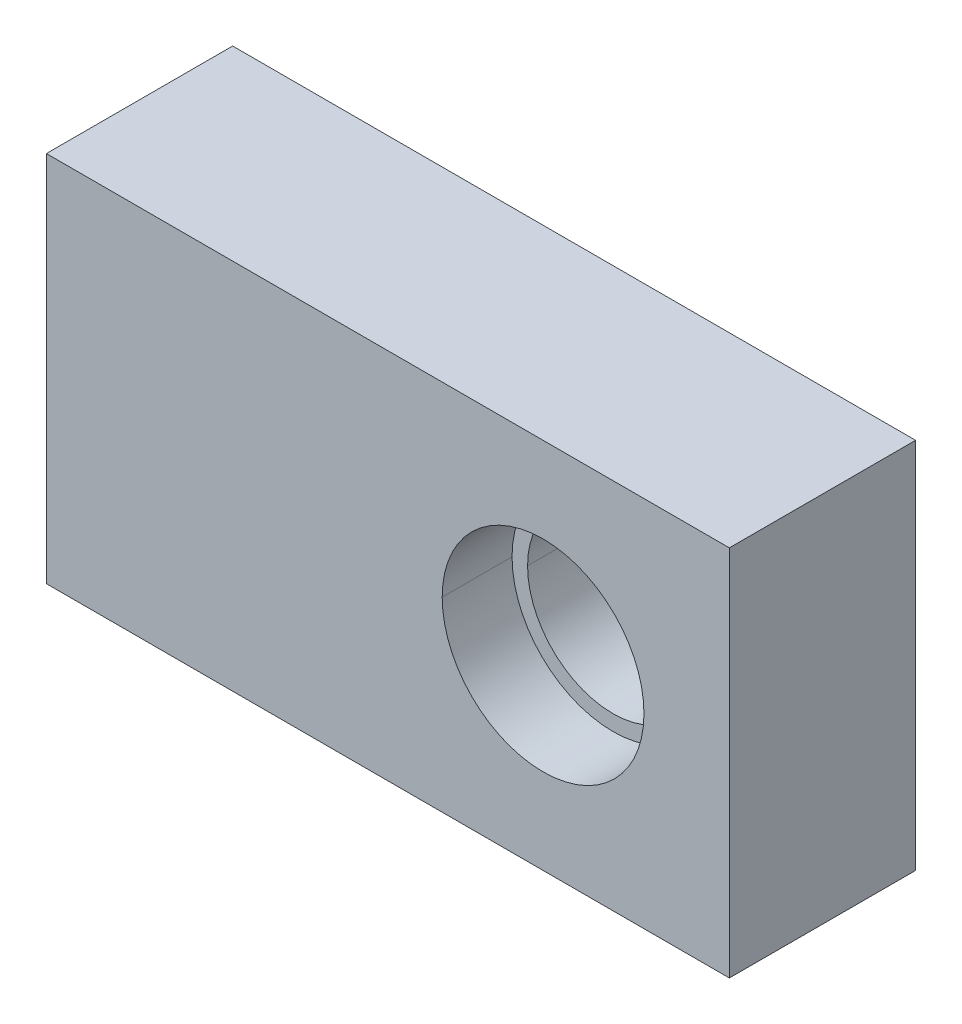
ISO-10303-21;
HEADER;
FILE_DESCRIPTION(('STEP AP214'),'2;1');
FILE_NAME('part.step','',(''),(''),'','','');
FILE_SCHEMA(('AUTOMOTIVE_DESIGN { 1 0 10303 214 1 1 1 1 }'));
ENDSEC;
DATA;
#1=APPLICATION_CONTEXT('core data for automotive mechanical design processes');
#2=APPLICATION_PROTOCOL_DEFINITION('international standard','automotive_design',2000,#1);
#3=PRODUCT_CONTEXT('',#1,'mechanical');
#4=PRODUCT('Part','Part','',(#3));
#5=PRODUCT_RELATED_PRODUCT_CATEGORY('part','',(#4));
#6=PRODUCT_DEFINITION_FORMATION('','',#4);
#7=PRODUCT_DEFINITION_CONTEXT('part definition',#1,'design');
#8=PRODUCT_DEFINITION('design','',#6,#7);
#9=PRODUCT_DEFINITION_SHAPE('','',#8);
#10=(LENGTH_UNIT() NAMED_UNIT(*) SI_UNIT(.MILLI.,.METRE.));
#11=(NAMED_UNIT(*) PLANE_ANGLE_UNIT() SI_UNIT($,.RADIAN.));
#12=(NAMED_UNIT(*) SI_UNIT($,.STERADIAN.) SOLID_ANGLE_UNIT());
#13=UNCERTAINTY_MEASURE_WITH_UNIT(LENGTH_MEASURE(1.E-05),#10,'distance_accuracy_value','');
#14=(GEOMETRIC_REPRESENTATION_CONTEXT(3) GLOBAL_UNCERTAINTY_ASSIGNED_CONTEXT((#13)) GLOBAL_UNIT_ASSIGNED_CONTEXT((#10,
#11,#12)) REPRESENTATION_CONTEXT('',''));
#15=CARTESIAN_POINT('',(0.,0.,0.));
#16=DIRECTION('',(0.,0.,1.));
#17=DIRECTION('',(1.,0.,0.));
#18=AXIS2_PLACEMENT_3D('',#15,#16,#17);
#19=CARTESIAN_POINT('',(-44.45,-19.05,0.));
#20=DIRECTION('',(1.,0.,0.));
#21=DIRECTION('',(0.,0.,-1.));
#22=AXIS2_PLACEMENT_3D('',#19,#20,#21);
#23=PLANE('',#22);
#24=CARTESIAN_POINT('',(-44.45,-19.05,0.));
#25=DIRECTION('',(-1.,0.,0.));
#26=DIRECTION('',(0.,0.,1.));
#27=AXIS2_PLACEMENT_3D('',#24,#25,#26);
#28=CIRCLE('',#27,3.96875);
#29=CARTESIAN_POINT('',(-44.45,-23.01875,0.));
#30=VERTEX_POINT('',#29);
#31=CARTESIAN_POINT('',(-44.45,-15.08125,0.));
#32=VERTEX_POINT('',#31);
#33=EDGE_CURVE('E163',#30,#32,#28,.T.);
#34=ORIENTED_EDGE('',*,*,#33,.T.);
#35=CARTESIAN_POINT('',(-44.45,-19.05,0.));
#36=DIRECTION('',(-1.,0.,0.));
#37=DIRECTION('',(0.,0.,1.));
#38=AXIS2_PLACEMENT_3D('',#35,#36,#37);
#39=CIRCLE('',#38,3.96875);
#40=EDGE_CURVE('E119',#32,#30,#39,.T.);
#41=ORIENTED_EDGE('',*,*,#40,.T.);
#42=EDGE_LOOP('',(#34,#41));
#43=FACE_BOUND('',#42,.T.);
#44=ADVANCED_FACE('F16',(#43),#23,.F.);
#45=CARTESIAN_POINT('',(-44.45,19.05,0.));
#46=DIRECTION('',(1.,0.,0.));
#47=DIRECTION('',(0.,0.,-1.));
#48=AXIS2_PLACEMENT_3D('',#45,#46,#47);
#49=PLANE('',#48);
#50=CARTESIAN_POINT('',(-44.45,19.05,0.));
#51=DIRECTION('',(-1.,0.,0.));
#52=DIRECTION('',(0.,0.,1.));
#53=AXIS2_PLACEMENT_3D('',#50,#51,#52);
#54=CIRCLE('',#53,3.96875);
#55=CARTESIAN_POINT('',(-44.45,15.08125,0.));
#56=VERTEX_POINT('',#55);
#57=CARTESIAN_POINT('',(-44.45,23.01875,0.));
#58=VERTEX_POINT('',#57);
#59=EDGE_CURVE('E155',#56,#58,#54,.T.);
#60=ORIENTED_EDGE('',*,*,#59,.T.);
#61=CARTESIAN_POINT('',(-44.45,19.05,0.));
#62=DIRECTION('',(-1.,0.,0.));
#63=DIRECTION('',(0.,0.,1.));
#64=AXIS2_PLACEMENT_3D('',#61,#62,#63);
#65=CIRCLE('',#64,3.96875);
#66=EDGE_CURVE('E159',#58,#56,#65,.T.);
#67=ORIENTED_EDGE('',*,*,#66,.T.);
#68=EDGE_LOOP('',(#60,#67));
#69=FACE_BOUND('',#68,.T.);
#70=ADVANCED_FACE('F270',(#69),#49,.F.);
#71=CARTESIAN_POINT('',(31.75,0.,15.08125));
#72=DIRECTION('',(0.,0.,1.));
#73=DIRECTION('',(1.,0.,0.));
#74=AXIS2_PLACEMENT_3D('',#71,#72,#73);
#75=CYLINDRICAL_SURFACE('',#74,20.6375);
#76=CARTESIAN_POINT('',(31.75,0.,19.05));
#77=DIRECTION('',(0.,0.,1.));
#78=DIRECTION('',(1.,0.,0.));
#79=AXIS2_PLACEMENT_3D('',#76,#77,#78);
#80=CIRCLE('',#79,20.6375);
#81=CARTESIAN_POINT('',(52.3875,0.,19.05));
#82=VERTEX_POINT('',#81);
#83=CARTESIAN_POINT('',(11.1125,0.,19.05));
#84=VERTEX_POINT('',#83);
#85=EDGE_CURVE('E121',#82,#84,#80,.T.);
#86=ORIENTED_EDGE('',*,*,#85,.T.);
#87=DIRECTION('',(0.,0.,1.));
#88=VECTOR('',#87,1.);
#89=CARTESIAN_POINT('',(11.1125,0.,15.08125));
#90=LINE('',#89,#88);
#91=CARTESIAN_POINT('',(11.1125,0.,4.7625));
#92=VERTEX_POINT('',#91);
#93=EDGE_CURVE('E115',#84,#92,#90,.F.);
#94=ORIENTED_EDGE('',*,*,#93,.T.);
#95=CARTESIAN_POINT('',(31.75,0.,4.7625));
#96=DIRECTION('',(0.,0.,1.));
#97=DIRECTION('',(1.,0.,0.));
#98=AXIS2_PLACEMENT_3D('',#95,#96,#97);
#99=CIRCLE('',#98,20.6375);
#100=CARTESIAN_POINT('',(52.3875,0.,4.7625));
#101=VERTEX_POINT('',#100);
#102=EDGE_CURVE('E19',#92,#101,#99,.F.);
#103=ORIENTED_EDGE('',*,*,#102,.T.);
#104=DIRECTION('',(0.,0.,1.));
#105=VECTOR('',#104,1.);
#106=CARTESIAN_POINT('',(52.3875,0.,15.08125));
#107=LINE('',#106,#105);
#108=EDGE_CURVE('E108',#101,#82,#107,.T.);
#109=ORIENTED_EDGE('',*,*,#108,.T.);
#110=EDGE_LOOP('',(#86,#94,#103,#109));
#111=FACE_BOUND('',#110,.T.);
#112=ADVANCED_FACE('F120',(#111),#75,.F.);
#113=CARTESIAN_POINT('',(31.75,0.,15.08125));
#114=DIRECTION('',(0.,0.,1.));
#115=DIRECTION('',(1.,0.,0.));
#116=AXIS2_PLACEMENT_3D('',#113,#114,#115);
#117=CYLINDRICAL_SURFACE('',#116,20.6375);
#118=CARTESIAN_POINT('',(31.75,0.,4.7625));
#119=DIRECTION('',(0.,0.,1.));
#120=DIRECTION('',(1.,0.,0.));
#121=AXIS2_PLACEMENT_3D('',#118,#119,#120);
#122=CIRCLE('',#121,20.6375);
#123=EDGE_CURVE('E110',#101,#92,#122,.F.);
#124=ORIENTED_EDGE('',*,*,#123,.T.);
#125=ORIENTED_EDGE('',*,*,#93,.F.);
#126=CARTESIAN_POINT('',(31.75,0.,19.05));
#127=DIRECTION('',(0.,0.,1.));
#128=DIRECTION('',(1.,0.,0.));
#129=AXIS2_PLACEMENT_3D('',#126,#127,#128);
#130=CIRCLE('',#129,20.6375);
#131=EDGE_CURVE('E112',#84,#82,#130,.T.);
#132=ORIENTED_EDGE('',*,*,#131,.T.);
#133=ORIENTED_EDGE('',*,*,#108,.F.);
#134=EDGE_LOOP('',(#124,#125,#132,#133));
#135=FACE_BOUND('',#134,.T.);
#136=ADVANCED_FACE('F109',(#135),#117,.F.);
#137=CARTESIAN_POINT('',(31.7500000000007,0.,4.7625));
#138=DIRECTION('',(0.,0.,-1.));
#139=DIRECTION('',(-1.,0.,0.));
#140=AXIS2_PLACEMENT_3D('',#137,#138,#139);
#141=PLANE('',#140);
#142=ORIENTED_EDGE('',*,*,#102,.F.);
#143=ORIENTED_EDGE('',*,*,#123,.F.);
#144=EDGE_LOOP('',(#142,#143));
#145=FACE_BOUND('',#144,.T.);
#146=CARTESIAN_POINT('',(31.75,0.,4.7625));
#147=DIRECTION('',(0.,0.,1.));
#148=DIRECTION('',(1.,0.,0.));
#149=AXIS2_PLACEMENT_3D('',#146,#147,#148);
#150=CIRCLE('',#149,17.4625);
#151=CARTESIAN_POINT('',(14.2875,1.10707178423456E-13,4.7625));
#152=VERTEX_POINT('',#151);
#153=CARTESIAN_POINT('',(49.2125,0.,4.7625));
#154=VERTEX_POINT('',#153);
#155=EDGE_CURVE('E149',#152,#154,#150,.F.);
#156=ORIENTED_EDGE('',*,*,#155,.T.);
#157=CARTESIAN_POINT('',(31.75,0.,4.7625));
#158=DIRECTION('',(0.,0.,1.));
#159=DIRECTION('',(1.,0.,0.));
#160=AXIS2_PLACEMENT_3D('',#157,#158,#159);
#161=CIRCLE('',#160,17.4625);
#162=EDGE_CURVE('E145',#154,#152,#161,.F.);
#163=ORIENTED_EDGE('',*,*,#162,.T.);
#164=EDGE_LOOP('',(#156,#163));
#165=FACE_BOUND('',#164,.T.);
#166=ADVANCED_FACE('F117',(#145,#165),#141,.F.);
#167=CARTESIAN_POINT('',(-57.15,-19.05,0.));
#168=DIRECTION('',(-1.,0.,0.));
#169=DIRECTION('',(0.,0.,1.));
#170=AXIS2_PLACEMENT_3D('',#167,#168,#169);
#171=CYLINDRICAL_SURFACE('',#170,3.96875);
#172=ORIENTED_EDGE('',*,*,#40,.F.);
#173=DIRECTION('',(-1.,0.,0.));
#174=VECTOR('',#173,1.);
#175=CARTESIAN_POINT('',(-57.15,-15.08125,0.));
#176=LINE('',#175,#174);
#177=CARTESIAN_POINT('',(-69.85,-15.08125,0.));
#178=VERTEX_POINT('',#177);
#179=EDGE_CURVE('E166',#32,#178,#176,.T.);
#180=ORIENTED_EDGE('',*,*,#179,.T.);
#181=CARTESIAN_POINT('',(-69.85,-19.05,0.));
#182=DIRECTION('',(-1.,0.,0.));
#183=DIRECTION('',(0.,0.,1.));
#184=AXIS2_PLACEMENT_3D('',#181,#182,#183);
#185=CIRCLE('',#184,3.96875);
#186=CARTESIAN_POINT('',(-69.85,-23.01875,0.));
#187=VERTEX_POINT('',#186);
#188=EDGE_CURVE('E142',#187,#178,#185,.F.);
#189=ORIENTED_EDGE('',*,*,#188,.F.);
#190=DIRECTION('',(-1.,0.,0.));
#191=VECTOR('',#190,1.);
#192=CARTESIAN_POINT('',(-57.15,-23.01875,0.));
#193=LINE('',#192,#191);
#194=EDGE_CURVE('E162',#187,#30,#193,.F.);
#195=ORIENTED_EDGE('',*,*,#194,.T.);
#196=EDGE_LOOP('',(#172,#180,#189,#195));
#197=FACE_BOUND('',#196,.T.);
#198=ADVANCED_FACE('F174',(#197),#171,.F.);
#199=CARTESIAN_POINT('',(-57.15,-19.05,0.));
#200=DIRECTION('',(-1.,0.,0.));
#201=DIRECTION('',(0.,0.,1.));
#202=AXIS2_PLACEMENT_3D('',#199,#200,#201);
#203=CYLINDRICAL_SURFACE('',#202,3.96875);
#204=CARTESIAN_POINT('',(-69.85,-19.05,0.));
#205=DIRECTION('',(-1.,0.,0.));
#206=DIRECTION('',(0.,0.,1.));
#207=AXIS2_PLACEMENT_3D('',#204,#205,#206);
#208=CIRCLE('',#207,3.96875);
#209=EDGE_CURVE('E139',#178,#187,#208,.F.);
#210=ORIENTED_EDGE('',*,*,#209,.F.);
#211=ORIENTED_EDGE('',*,*,#179,.F.);
#212=ORIENTED_EDGE('',*,*,#33,.F.);
#213=ORIENTED_EDGE('',*,*,#194,.F.);
#214=EDGE_LOOP('',(#210,#211,#212,#213));
#215=FACE_BOUND('',#214,.T.);
#216=ADVANCED_FACE('F259',(#215),#203,.F.);
#217=CARTESIAN_POINT('',(-57.15,19.05,0.));
#218=DIRECTION('',(-1.,0.,0.));
#219=DIRECTION('',(0.,0.,1.));
#220=AXIS2_PLACEMENT_3D('',#217,#218,#219);
#221=CYLINDRICAL_SURFACE('',#220,3.96875);
#222=ORIENTED_EDGE('',*,*,#66,.F.);
#223=DIRECTION('',(-1.,0.,0.));
#224=VECTOR('',#223,1.);
#225=CARTESIAN_POINT('',(-57.15,23.01875,0.));
#226=LINE('',#225,#224);
#227=CARTESIAN_POINT('',(-69.85,23.01875,0.));
#228=VERTEX_POINT('',#227);
#229=EDGE_CURVE('E158',#58,#228,#226,.T.);
#230=ORIENTED_EDGE('',*,*,#229,.T.);
#231=CARTESIAN_POINT('',(-69.85,19.05,0.));
#232=DIRECTION('',(-1.,0.,0.));
#233=DIRECTION('',(0.,0.,1.));
#234=AXIS2_PLACEMENT_3D('',#231,#232,#233);
#235=CIRCLE('',#234,3.96875);
#236=CARTESIAN_POINT('',(-69.85,15.08125,0.));
#237=VERTEX_POINT('',#236);
#238=EDGE_CURVE('E137',#237,#228,#235,.F.);
#239=ORIENTED_EDGE('',*,*,#238,.F.);
#240=DIRECTION('',(-1.,0.,0.));
#241=VECTOR('',#240,1.);
#242=CARTESIAN_POINT('',(-57.15,15.08125,0.));
#243=LINE('',#242,#241);
#244=EDGE_CURVE('E154',#237,#56,#243,.F.);
#245=ORIENTED_EDGE('',*,*,#244,.T.);
#246=EDGE_LOOP('',(#222,#230,#239,#245));
#247=FACE_BOUND('',#246,.T.);
#248=ADVANCED_FACE('F255',(#247),#221,.F.);
#249=CARTESIAN_POINT('',(-57.15,19.05,0.));
#250=DIRECTION('',(-1.,0.,0.));
#251=DIRECTION('',(0.,0.,1.));
#252=AXIS2_PLACEMENT_3D('',#249,#250,#251);
#253=CYLINDRICAL_SURFACE('',#252,3.96875);
#254=CARTESIAN_POINT('',(-69.85,19.05,0.));
#255=DIRECTION('',(-1.,0.,0.));
#256=DIRECTION('',(0.,0.,1.));
#257=AXIS2_PLACEMENT_3D('',#254,#255,#256);
#258=CIRCLE('',#257,3.96875);
#259=EDGE_CURVE('E133',#228,#237,#258,.F.);
#260=ORIENTED_EDGE('',*,*,#259,.F.);
#261=ORIENTED_EDGE('',*,*,#229,.F.);
#262=ORIENTED_EDGE('',*,*,#59,.F.);
#263=ORIENTED_EDGE('',*,*,#244,.F.);
#264=EDGE_LOOP('',(#260,#261,#262,#263));
#265=FACE_BOUND('',#264,.T.);
#266=ADVANCED_FACE('F251',(#265),#253,.F.);
#267=CARTESIAN_POINT('',(-38.1,0.,19.05));
#268=DIRECTION('',(0.,0.,-1.));
#269=DIRECTION('',(-1.,0.,0.));
#270=AXIS2_PLACEMENT_3D('',#267,#268,#269);
#271=PLANE('',#270);
#272=DIRECTION('',(0.,1.,0.));
#273=VECTOR('',#272,1.);
#274=CARTESIAN_POINT('',(69.85,0.,19.05));
#275=LINE('',#274,#273);
#276=CARTESIAN_POINT('',(69.85,-38.1,19.05));
#277=VERTEX_POINT('',#276);
#278=CARTESIAN_POINT('',(69.85,38.1,19.05));
#279=VERTEX_POINT('',#278);
#280=EDGE_CURVE('E194',#277,#279,#275,.T.);
#281=ORIENTED_EDGE('',*,*,#280,.T.);
#282=DIRECTION('',(1.,0.,0.));
#283=VECTOR('',#282,1.);
#284=CARTESIAN_POINT('',(-38.1,38.1,19.05));
#285=LINE('',#284,#283);
#286=CARTESIAN_POINT('',(-69.85,38.1,19.05));
#287=VERTEX_POINT('',#286);
#288=EDGE_CURVE('E132',#279,#287,#285,.F.);
#289=ORIENTED_EDGE('',*,*,#288,.T.);
#290=DIRECTION('',(0.,1.,0.));
#291=VECTOR('',#290,1.);
#292=CARTESIAN_POINT('',(-69.85,0.,19.05));
#293=LINE('',#292,#291);
#294=CARTESIAN_POINT('',(-69.85,-38.1,19.05));
#295=VERTEX_POINT('',#294);
#296=EDGE_CURVE('E136',#295,#287,#293,.T.);
#297=ORIENTED_EDGE('',*,*,#296,.F.);
#298=DIRECTION('',(1.,0.,0.));
#299=VECTOR('',#298,1.);
#300=CARTESIAN_POINT('',(-38.1,-38.1,19.05));
#301=LINE('',#300,#299);
#302=EDGE_CURVE('E191',#295,#277,#301,.T.);
#303=ORIENTED_EDGE('',*,*,#302,.T.);
#304=EDGE_LOOP('',(#281,#289,#297,#303));
#305=FACE_BOUND('',#304,.T.);
#306=ORIENTED_EDGE('',*,*,#85,.F.);
#307=ORIENTED_EDGE('',*,*,#131,.F.);
#308=EDGE_LOOP('',(#306,#307));
#309=FACE_BOUND('',#308,.T.);
#310=ADVANCED_FACE('F247',(#305,#309),#271,.F.);
#311=CARTESIAN_POINT('',(31.75,0.,-6.35));
#312=DIRECTION('',(0.,0.,1.));
#313=DIRECTION('',(1.,0.,0.));
#314=AXIS2_PLACEMENT_3D('',#311,#312,#313);
#315=CYLINDRICAL_SURFACE('',#314,17.4625);
#316=ORIENTED_EDGE('',*,*,#155,.F.);
#317=DIRECTION('',(0.,0.,1.));
#318=VECTOR('',#317,1.);
#319=CARTESIAN_POINT('',(14.2875,1.33971901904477E-13,-6.35));
#320=LINE('',#319,#318);
#321=CARTESIAN_POINT('',(14.2875,1.10707178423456E-13,-19.05));
#322=VERTEX_POINT('',#321);
#323=EDGE_CURVE('E148',#152,#322,#320,.F.);
#324=ORIENTED_EDGE('',*,*,#323,.T.);
#325=CARTESIAN_POINT('',(31.75,0.,-19.05));
#326=DIRECTION('',(0.,0.,1.));
#327=DIRECTION('',(1.,0.,0.));
#328=AXIS2_PLACEMENT_3D('',#325,#326,#327);
#329=CIRCLE('',#328,17.4625);
#330=CARTESIAN_POINT('',(49.2125,0.,-19.05));
#331=VERTEX_POINT('',#330);
#332=EDGE_CURVE('E129',#322,#331,#329,.F.);
#333=ORIENTED_EDGE('',*,*,#332,.T.);
#334=DIRECTION('',(0.,0.,1.));
#335=VECTOR('',#334,1.);
#336=CARTESIAN_POINT('',(49.2125,0.,-6.35));
#337=LINE('',#336,#335);
#338=EDGE_CURVE('E144',#331,#154,#337,.T.);
#339=ORIENTED_EDGE('',*,*,#338,.T.);
#340=EDGE_LOOP('',(#316,#324,#333,#339));
#341=FACE_BOUND('',#340,.T.);
#342=ADVANCED_FACE('F243',(#341),#315,.F.);
#343=CARTESIAN_POINT('',(31.75,0.,-6.35));
#344=DIRECTION('',(0.,0.,1.));
#345=DIRECTION('',(1.,0.,0.));
#346=AXIS2_PLACEMENT_3D('',#343,#344,#345);
#347=CYLINDRICAL_SURFACE('',#346,17.4625);
#348=CARTESIAN_POINT('',(31.75,0.,-19.05));
#349=DIRECTION('',(0.,0.,1.));
#350=DIRECTION('',(1.,0.,0.));
#351=AXIS2_PLACEMENT_3D('',#348,#349,#350);
#352=CIRCLE('',#351,17.4625);
#353=EDGE_CURVE('E125',#331,#322,#352,.F.);
#354=ORIENTED_EDGE('',*,*,#353,.T.);
#355=ORIENTED_EDGE('',*,*,#323,.F.);
#356=ORIENTED_EDGE('',*,*,#162,.F.);
#357=ORIENTED_EDGE('',*,*,#338,.F.);
#358=EDGE_LOOP('',(#354,#355,#356,#357));
#359=FACE_BOUND('',#358,.T.);
#360=ADVANCED_FACE('F240',(#359),#347,.F.);
#361=CARTESIAN_POINT('',(-69.85,0.,0.));
#362=DIRECTION('',(-1.,0.,0.));
#363=DIRECTION('',(0.,0.,1.));
#364=AXIS2_PLACEMENT_3D('',#361,#362,#363);
#365=PLANE('',#364);
#366=DIRECTION('',(0.,0.,-1.));
#367=VECTOR('',#366,1.);
#368=CARTESIAN_POINT('',(-69.85,38.1,0.));
#369=LINE('',#368,#367);
#370=CARTESIAN_POINT('',(-69.85,38.1,-19.05));
#371=VERTEX_POINT('',#370);
#372=EDGE_CURVE('E199',#287,#371,#369,.T.);
#373=ORIENTED_EDGE('',*,*,#372,.T.);
#374=DIRECTION('',(0.,1.,0.));
#375=VECTOR('',#374,1.);
#376=CARTESIAN_POINT('',(-69.85,0.,-19.05));
#377=LINE('',#376,#375);
#378=CARTESIAN_POINT('',(-69.85,-38.1,-19.05));
#379=VERTEX_POINT('',#378);
#380=EDGE_CURVE('E128',#371,#379,#377,.F.);
#381=ORIENTED_EDGE('',*,*,#380,.T.);
#382=DIRECTION('',(0.,0.,1.));
#383=VECTOR('',#382,1.);
#384=CARTESIAN_POINT('',(-69.85,-38.1,0.));
#385=LINE('',#384,#383);
#386=EDGE_CURVE('E188',#379,#295,#385,.T.);
#387=ORIENTED_EDGE('',*,*,#386,.T.);
#388=ORIENTED_EDGE('',*,*,#296,.T.);
#389=EDGE_LOOP('',(#373,#381,#387,#388));
#390=FACE_BOUND('',#389,.T.);
#391=ORIENTED_EDGE('',*,*,#238,.T.);
#392=ORIENTED_EDGE('',*,*,#259,.T.);
#393=EDGE_LOOP('',(#391,#392));
#394=FACE_BOUND('',#393,.T.);
#395=ORIENTED_EDGE('',*,*,#188,.T.);
#396=ORIENTED_EDGE('',*,*,#209,.T.);
#397=EDGE_LOOP('',(#395,#396));
#398=FACE_BOUND('',#397,.T.);
#399=ADVANCED_FACE('F222',(#390,#394,#398),#365,.T.);
#400=CARTESIAN_POINT('',(-38.1,-38.1,0.));
#401=DIRECTION('',(0.,1.,0.));
#402=DIRECTION('',(0.,0.,1.));
#403=AXIS2_PLACEMENT_3D('',#400,#401,#402);
#404=PLANE('',#403);
#405=DIRECTION('',(0.,0.,1.));
#406=VECTOR('',#405,1.);
#407=CARTESIAN_POINT('',(69.85,-38.1,0.));
#408=LINE('',#407,#406);
#409=CARTESIAN_POINT('',(69.85,-38.1,-19.05));
#410=VERTEX_POINT('',#409);
#411=EDGE_CURVE('E196',#410,#277,#408,.T.);
#412=ORIENTED_EDGE('',*,*,#411,.T.);
#413=ORIENTED_EDGE('',*,*,#302,.F.);
#414=ORIENTED_EDGE('',*,*,#386,.F.);
#415=DIRECTION('',(1.,0.,0.));
#416=VECTOR('',#415,1.);
#417=CARTESIAN_POINT('',(-38.1,-38.1,-19.05));
#418=LINE('',#417,#416);
#419=EDGE_CURVE('E207',#379,#410,#418,.T.);
#420=ORIENTED_EDGE('',*,*,#419,.T.);
#421=EDGE_LOOP('',(#412,#413,#414,#420));
#422=FACE_BOUND('',#421,.T.);
#423=ADVANCED_FACE('F219',(#422),#404,.F.);
#424=CARTESIAN_POINT('',(69.85,0.,0.));
#425=DIRECTION('',(-1.,0.,0.));
#426=DIRECTION('',(0.,0.,1.));
#427=AXIS2_PLACEMENT_3D('',#424,#425,#426);
#428=PLANE('',#427);
#429=DIRECTION('',(0.,1.,0.));
#430=VECTOR('',#429,1.);
#431=CARTESIAN_POINT('',(69.85,0.,-19.05));
#432=LINE('',#431,#430);
#433=CARTESIAN_POINT('',(69.85,38.1,-19.05));
#434=VERTEX_POINT('',#433);
#435=EDGE_CURVE('E25',#410,#434,#432,.T.);
#436=ORIENTED_EDGE('',*,*,#435,.T.);
#437=DIRECTION('',(0.,0.,-1.));
#438=VECTOR('',#437,1.);
#439=CARTESIAN_POINT('',(69.85,38.1,0.));
#440=LINE('',#439,#438);
#441=EDGE_CURVE('E33',#434,#279,#440,.F.);
#442=ORIENTED_EDGE('',*,*,#441,.T.);
#443=ORIENTED_EDGE('',*,*,#280,.F.);
#444=ORIENTED_EDGE('',*,*,#411,.F.);
#445=EDGE_LOOP('',(#436,#442,#443,#444));
#446=FACE_BOUND('',#445,.T.);
#447=ADVANCED_FACE('F213',(#446),#428,.F.);
#448=CARTESIAN_POINT('',(-38.1,38.1,0.));
#449=DIRECTION('',(0.,-1.,0.));
#450=DIRECTION('',(0.,0.,-1.));
#451=AXIS2_PLACEMENT_3D('',#448,#449,#450);
#452=PLANE('',#451);
#453=ORIENTED_EDGE('',*,*,#441,.F.);
#454=DIRECTION('',(1.,0.,0.));
#455=VECTOR('',#454,1.);
#456=CARTESIAN_POINT('',(-38.1,38.1,-19.05));
#457=LINE('',#456,#455);
#458=EDGE_CURVE('E11',#434,#371,#457,.F.);
#459=ORIENTED_EDGE('',*,*,#458,.T.);
#460=ORIENTED_EDGE('',*,*,#372,.F.);
#461=ORIENTED_EDGE('',*,*,#288,.F.);
#462=EDGE_LOOP('',(#453,#459,#460,#461));
#463=FACE_BOUND('',#462,.T.);
#464=ADVANCED_FACE('F225',(#463),#452,.F.);
#465=CARTESIAN_POINT('',(-38.1,0.,-19.05));
#466=DIRECTION('',(0.,0.,1.));
#467=DIRECTION('',(1.,0.,0.));
#468=AXIS2_PLACEMENT_3D('',#465,#466,#467);
#469=PLANE('',#468);
#470=ORIENTED_EDGE('',*,*,#435,.F.);
#471=ORIENTED_EDGE('',*,*,#419,.F.);
#472=ORIENTED_EDGE('',*,*,#380,.F.);
#473=ORIENTED_EDGE('',*,*,#458,.F.);
#474=EDGE_LOOP('',(#470,#471,#472,#473));
#475=FACE_BOUND('',#474,.T.);
#476=ORIENTED_EDGE('',*,*,#332,.F.);
#477=ORIENTED_EDGE('',*,*,#353,.F.);
#478=EDGE_LOOP('',(#476,#477));
#479=FACE_BOUND('',#478,.T.);
#480=ADVANCED_FACE('F216',(#475,#479),#469,.F.);
#481=CLOSED_SHELL('',(#44,#70,#112,#136,#166,#198,#216,#248,#266,#310,#342,#360,#399,#423,#447,
#464,#480));
#482=MANIFOLD_SOLID_BREP('B1',#481);
#483=ADVANCED_BREP_SHAPE_REPRESENTATION('',(#18,#482),#14);
#484=SHAPE_DEFINITION_REPRESENTATION(#9,#483);
ENDSEC;
END-ISO-10303-21;
